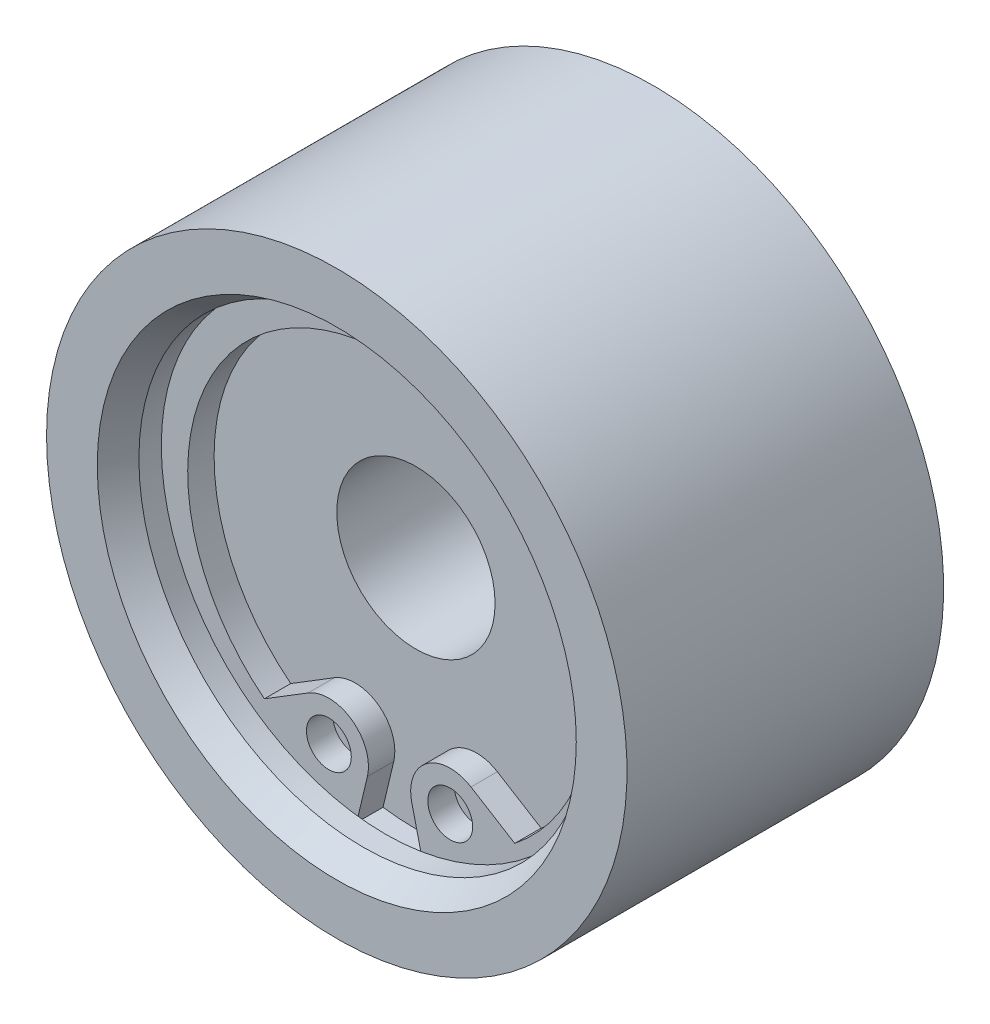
ISO-10303-21;
HEADER;
FILE_DESCRIPTION(('STEP AP214'),'2;1');
FILE_NAME('part.step','',(''),(''),'','','');
FILE_SCHEMA(('AUTOMOTIVE_DESIGN { 1 0 10303 214 1 1 1 1 }'));
ENDSEC;
DATA;
#1=APPLICATION_CONTEXT('core data for automotive mechanical design processes');
#2=APPLICATION_PROTOCOL_DEFINITION('international standard','automotive_design',2000,#1);
#3=PRODUCT_CONTEXT('',#1,'mechanical');
#4=PRODUCT('Part','Part','',(#3));
#5=PRODUCT_RELATED_PRODUCT_CATEGORY('part','',(#4));
#6=PRODUCT_DEFINITION_FORMATION('','',#4);
#7=PRODUCT_DEFINITION_CONTEXT('part definition',#1,'design');
#8=PRODUCT_DEFINITION('design','',#6,#7);
#9=PRODUCT_DEFINITION_SHAPE('','',#8);
#10=(LENGTH_UNIT() NAMED_UNIT(*) SI_UNIT(.MILLI.,.METRE.));
#11=(NAMED_UNIT(*) PLANE_ANGLE_UNIT() SI_UNIT($,.RADIAN.));
#12=(NAMED_UNIT(*) SI_UNIT($,.STERADIAN.) SOLID_ANGLE_UNIT());
#13=UNCERTAINTY_MEASURE_WITH_UNIT(LENGTH_MEASURE(1.E-05),#10,'distance_accuracy_value','');
#14=(GEOMETRIC_REPRESENTATION_CONTEXT(3) GLOBAL_UNCERTAINTY_ASSIGNED_CONTEXT((#13)) GLOBAL_UNIT_ASSIGNED_CONTEXT((#10,
#11,#12)) REPRESENTATION_CONTEXT('',''));
#15=CARTESIAN_POINT('',(0.,0.,0.));
#16=DIRECTION('',(0.,0.,1.));
#17=DIRECTION('',(1.,0.,0.));
#18=AXIS2_PLACEMENT_3D('',#15,#16,#17);
#19=CARTESIAN_POINT('',(0.,3.,3.));
#20=DIRECTION('',(0.,0.,-1.));
#21=DIRECTION('',(-1.,0.,0.));
#22=AXIS2_PLACEMENT_3D('',#19,#20,#21);
#23=PLANE('',#22);
#24=CARTESIAN_POINT('',(2.3,-6.75644413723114,3.));
#25=DIRECTION('',(0.,0.,-1.));
#26=DIRECTION('',(-1.,0.,0.));
#27=AXIS2_PLACEMENT_3D('',#24,#25,#26);
#28=CIRCLE('',#27,0.85);
#29=CARTESIAN_POINT('',(1.45,-6.75644413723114,3.));
#30=VERTEX_POINT('',#29);
#31=EDGE_CURVE('E211',#30,#30,#28,.T.);
#32=ORIENTED_EDGE('',*,*,#31,.F.);
#33=EDGE_LOOP('',(#32));
#34=FACE_BOUND('',#33,.T.);
#35=ADVANCED_FACE('F14',(#34),#23,.F.);
#36=CARTESIAN_POINT('',(-2.3,-6.75644413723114,3.));
#37=DIRECTION('',(0.,0.,-1.));
#38=DIRECTION('',(-1.,0.,0.));
#39=AXIS2_PLACEMENT_3D('',#36,#37,#38);
#40=CIRCLE('',#39,0.85);
#41=CARTESIAN_POINT('',(-3.15,-6.75644413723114,3.));
#42=VERTEX_POINT('',#41);
#43=EDGE_CURVE('E207',#42,#42,#40,.T.);
#44=ORIENTED_EDGE('',*,*,#43,.F.);
#45=EDGE_LOOP('',(#44));
#46=FACE_BOUND('',#45,.T.);
#47=ADVANCED_FACE('F251',(#46),#23,.F.);
#48=CARTESIAN_POINT('',(0.,0.,8.6342229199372));
#49=DIRECTION('',(0.,0.,1.));
#50=DIRECTION('',(1.,0.,0.));
#51=AXIS2_PLACEMENT_3D('',#48,#49,#50);
#52=CYLINDRICAL_SURFACE('',#51,11.);
#53=CARTESIAN_POINT('',(0.,0.,6.));
#54=DIRECTION('',(0.,0.,-1.));
#55=DIRECTION('',(-1.,0.,0.));
#56=AXIS2_PLACEMENT_3D('',#53,#54,#55);
#57=CIRCLE('',#56,11.);
#58=CARTESIAN_POINT('',(-11.,0.,6.));
#59=VERTEX_POINT('',#58);
#60=EDGE_CURVE('E240',#59,#59,#57,.T.);
#61=ORIENTED_EDGE('',*,*,#60,.T.);
#62=EDGE_LOOP('',(#61));
#63=FACE_BOUND('',#62,.T.);
#64=CARTESIAN_POINT('',(0.,0.,-6.));
#65=DIRECTION('',(0.,0.,-1.));
#66=DIRECTION('',(-1.,0.,0.));
#67=AXIS2_PLACEMENT_3D('',#64,#65,#66);
#68=CIRCLE('',#67,11.);
#69=CARTESIAN_POINT('',(-11.,0.,-6.));
#70=VERTEX_POINT('',#69);
#71=EDGE_CURVE('E156',#70,#70,#68,.T.);
#72=ORIENTED_EDGE('',*,*,#71,.F.);
#73=EDGE_LOOP('',(#72));
#74=FACE_BOUND('',#73,.T.);
#75=ADVANCED_FACE('F248',(#63,#74),#52,.T.);
#76=CARTESIAN_POINT('',(0.,15.,6.));
#77=DIRECTION('',(0.,0.,-1.));
#78=DIRECTION('',(-1.,0.,0.));
#79=AXIS2_PLACEMENT_3D('',#76,#77,#78);
#80=PLANE('',#79);
#81=CARTESIAN_POINT('',(0.,0.,6.));
#82=DIRECTION('',(0.,0.,1.));
#83=DIRECTION('',(1.,0.,0.));
#84=AXIS2_PLACEMENT_3D('',#81,#82,#83);
#85=CIRCLE('',#84,9.07735026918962);
#86=CARTESIAN_POINT('',(9.07735026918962,0.,6.));
#87=VERTEX_POINT('',#86);
#88=EDGE_CURVE('E215',#87,#87,#85,.T.);
#89=ORIENTED_EDGE('',*,*,#88,.F.);
#90=EDGE_LOOP('',(#89));
#91=FACE_BOUND('',#90,.T.);
#92=ORIENTED_EDGE('',*,*,#60,.F.);
#93=EDGE_LOOP('',(#92));
#94=FACE_BOUND('',#93,.T.);
#95=ADVANCED_FACE('F250',(#91,#94),#80,.F.);
#96=CARTESIAN_POINT('',(0.,6.5,-6.));
#97=DIRECTION('',(0.,0.,1.));
#98=DIRECTION('',(1.,0.,0.));
#99=AXIS2_PLACEMENT_3D('',#96,#97,#98);
#100=PLANE('',#99);
#101=CARTESIAN_POINT('',(0.,0.,-6.));
#102=DIRECTION('',(0.,0.,1.));
#103=DIRECTION('',(1.,0.,0.));
#104=AXIS2_PLACEMENT_3D('',#101,#102,#103);
#105=CIRCLE('',#104,6.5);
#106=CARTESIAN_POINT('',(6.5,0.,-6.));
#107=VERTEX_POINT('',#106);
#108=EDGE_CURVE('E237',#107,#107,#105,.T.);
#109=ORIENTED_EDGE('',*,*,#108,.T.);
#110=EDGE_LOOP('',(#109));
#111=FACE_BOUND('',#110,.T.);
#112=ORIENTED_EDGE('',*,*,#71,.T.);
#113=EDGE_LOOP('',(#112));
#114=FACE_BOUND('',#113,.T.);
#115=ADVANCED_FACE('F246',(#111,#114),#100,.F.);
#116=CARTESIAN_POINT('',(0.,0.,6.));
#117=DIRECTION('',(0.,0.,1.));
#118=DIRECTION('',(1.,0.,0.));
#119=AXIS2_PLACEMENT_3D('',#116,#117,#118);
#120=CONICAL_SURFACE('',#119,9.07735026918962,0.523598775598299);
#121=CARTESIAN_POINT('',(0.,0.,5.));
#122=DIRECTION('',(0.,0.,1.));
#123=DIRECTION('',(1.,0.,0.));
#124=AXIS2_PLACEMENT_3D('',#121,#122,#123);
#125=CIRCLE('',#124,8.5);
#126=CARTESIAN_POINT('',(8.5,0.,5.));
#127=VERTEX_POINT('',#126);
#128=EDGE_CURVE('E218',#127,#127,#125,.T.);
#129=ORIENTED_EDGE('',*,*,#128,.F.);
#130=EDGE_LOOP('',(#129));
#131=FACE_BOUND('',#130,.T.);
#132=ORIENTED_EDGE('',*,*,#88,.T.);
#133=EDGE_LOOP('',(#132));
#134=FACE_BOUND('',#133,.T.);
#135=ADVANCED_FACE('F323',(#131,#134),#120,.F.);
#136=CARTESIAN_POINT('',(0.,0.,8.6342229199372));
#137=DIRECTION('',(0.,0.,1.));
#138=DIRECTION('',(1.,0.,0.));
#139=AXIS2_PLACEMENT_3D('',#136,#137,#138);
#140=CYLINDRICAL_SURFACE('',#139,6.5);
#141=ORIENTED_EDGE('',*,*,#108,.F.);
#142=EDGE_LOOP('',(#141));
#143=FACE_BOUND('',#142,.T.);
#144=CARTESIAN_POINT('',(0.,0.,-3.));
#145=DIRECTION('',(0.,0.,1.));
#146=DIRECTION('',(1.,0.,0.));
#147=AXIS2_PLACEMENT_3D('',#144,#145,#146);
#148=CIRCLE('',#147,6.5);
#149=CARTESIAN_POINT('',(6.5,0.,-3.));
#150=VERTEX_POINT('',#149);
#151=EDGE_CURVE('E234',#150,#150,#148,.T.);
#152=ORIENTED_EDGE('',*,*,#151,.T.);
#153=EDGE_LOOP('',(#152));
#154=FACE_BOUND('',#153,.T.);
#155=ADVANCED_FACE('F321',(#143,#154),#140,.F.);
#156=CARTESIAN_POINT('',(0.,0.,8.6342229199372));
#157=DIRECTION('',(0.,0.,1.));
#158=DIRECTION('',(1.,0.,0.));
#159=AXIS2_PLACEMENT_3D('',#156,#157,#158);
#160=CYLINDRICAL_SURFACE('',#159,8.5);
#161=CARTESIAN_POINT('',(0.,0.,4.15));
#162=DIRECTION('',(0.,0.,1.));
#163=DIRECTION('',(1.,0.,0.));
#164=AXIS2_PLACEMENT_3D('',#161,#162,#163);
#165=CIRCLE('',#164,8.5);
#166=CARTESIAN_POINT('',(8.5,0.,4.15));
#167=VERTEX_POINT('',#166);
#168=EDGE_CURVE('E221',#167,#167,#165,.T.);
#169=ORIENTED_EDGE('',*,*,#168,.F.);
#170=EDGE_LOOP('',(#169));
#171=FACE_BOUND('',#170,.T.);
#172=ORIENTED_EDGE('',*,*,#128,.T.);
#173=EDGE_LOOP('',(#172));
#174=FACE_BOUND('',#173,.T.);
#175=ADVANCED_FACE('F318',(#171,#174),#160,.F.);
#176=CARTESIAN_POINT('',(0.,6.5,-3.));
#177=DIRECTION('',(0.,0.,1.));
#178=DIRECTION('',(1.,0.,0.));
#179=AXIS2_PLACEMENT_3D('',#176,#177,#178);
#180=PLANE('',#179);
#181=ORIENTED_EDGE('',*,*,#151,.F.);
#182=EDGE_LOOP('',(#181));
#183=FACE_BOUND('',#182,.T.);
#184=CARTESIAN_POINT('',(0.,0.,-3.));
#185=DIRECTION('',(0.,0.,1.));
#186=DIRECTION('',(1.,0.,0.));
#187=AXIS2_PLACEMENT_3D('',#184,#185,#186);
#188=CIRCLE('',#187,3.);
#189=CARTESIAN_POINT('',(3.,0.,-3.));
#190=VERTEX_POINT('',#189);
#191=EDGE_CURVE('E231',#190,#190,#188,.T.);
#192=ORIENTED_EDGE('',*,*,#191,.T.);
#193=EDGE_LOOP('',(#192));
#194=FACE_BOUND('',#193,.T.);
#195=ADVANCED_FACE('F316',(#183,#194),#180,.F.);
#196=CARTESIAN_POINT('',(0.,8.9,4.15));
#197=DIRECTION('',(0.,0.,1.));
#198=DIRECTION('',(1.,0.,0.));
#199=AXIS2_PLACEMENT_3D('',#196,#197,#198);
#200=PLANE('',#199);
#201=CARTESIAN_POINT('',(0.,0.,4.15));
#202=DIRECTION('',(0.,0.,1.));
#203=DIRECTION('',(1.,0.,0.));
#204=AXIS2_PLACEMENT_3D('',#201,#202,#203);
#205=CIRCLE('',#204,8.9);
#206=CARTESIAN_POINT('',(8.9,0.,4.15));
#207=VERTEX_POINT('',#206);
#208=EDGE_CURVE('E224',#207,#207,#205,.T.);
#209=ORIENTED_EDGE('',*,*,#208,.F.);
#210=EDGE_LOOP('',(#209));
#211=FACE_BOUND('',#210,.T.);
#212=ORIENTED_EDGE('',*,*,#168,.T.);
#213=EDGE_LOOP('',(#212));
#214=FACE_BOUND('',#213,.T.);
#215=ADVANCED_FACE('F312',(#211,#214),#200,.F.);
#216=CARTESIAN_POINT('',(0.,0.,8.6342229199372));
#217=DIRECTION('',(0.,0.,1.));
#218=DIRECTION('',(1.,0.,0.));
#219=AXIS2_PLACEMENT_3D('',#216,#217,#218);
#220=CYLINDRICAL_SURFACE('',#219,8.9);
#221=ORIENTED_EDGE('',*,*,#208,.T.);
#222=EDGE_LOOP('',(#221));
#223=FACE_BOUND('',#222,.T.);
#224=DIRECTION('',(0.,0.,1.));
#225=VECTOR('',#224,1.);
#226=CARTESIAN_POINT('',(1.24703201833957,-8.81220240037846,8.6342229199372));
#227=LINE('',#226,#225);
#228=CARTESIAN_POINT('',(1.24703201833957,-8.81220240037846,3.));
#229=VERTEX_POINT('',#228);
#230=CARTESIAN_POINT('',(1.24703201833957,-8.81220240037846,4.));
#231=VERTEX_POINT('',#230);
#232=EDGE_CURVE('E9',#229,#231,#227,.T.);
#233=ORIENTED_EDGE('',*,*,#232,.F.);
#234=CARTESIAN_POINT('',(0.,0.,3.));
#235=DIRECTION('',(0.,0.,1.));
#236=DIRECTION('',(1.,0.,0.));
#237=AXIS2_PLACEMENT_3D('',#234,#235,#236);
#238=CIRCLE('',#237,8.9);
#239=CARTESIAN_POINT('',(-1.24703201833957,-8.81220240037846,3.));
#240=VERTEX_POINT('',#239);
#241=EDGE_CURVE('E103',#240,#229,#238,.T.);
#242=ORIENTED_EDGE('',*,*,#241,.F.);
#243=DIRECTION('',(0.,0.,1.));
#244=VECTOR('',#243,1.);
#245=CARTESIAN_POINT('',(-1.24703201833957,-8.81220240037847,8.6342229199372));
#246=LINE('',#245,#244);
#247=CARTESIAN_POINT('',(-1.24703201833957,-8.81220240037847,4.));
#248=VERTEX_POINT('',#247);
#249=EDGE_CURVE('E106',#248,#240,#246,.F.);
#250=ORIENTED_EDGE('',*,*,#249,.F.);
#251=CARTESIAN_POINT('',(0.,0.,4.));
#252=DIRECTION('',(0.,0.,-1.));
#253=DIRECTION('',(-1.,0.,0.));
#254=AXIS2_PLACEMENT_3D('',#251,#252,#253);
#255=CIRCLE('',#254,8.9);
#256=EDGE_CURVE('E23',#231,#248,#255,.F.);
#257=ORIENTED_EDGE('',*,*,#256,.F.);
#258=EDGE_LOOP('',(#233,#242,#250,#257));
#259=FACE_BOUND('',#258,.T.);
#260=ADVANCED_FACE('F309',(#223,#259),#220,.F.);
#261=CARTESIAN_POINT('',(0.,0.,8.6342229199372));
#262=DIRECTION('',(0.,0.,1.));
#263=DIRECTION('',(1.,0.,0.));
#264=AXIS2_PLACEMENT_3D('',#261,#262,#263);
#265=CYLINDRICAL_SURFACE('',#264,3.);
#266=ORIENTED_EDGE('',*,*,#191,.F.);
#267=EDGE_LOOP('',(#266));
#268=FACE_BOUND('',#267,.T.);
#269=CARTESIAN_POINT('',(0.,0.,3.));
#270=DIRECTION('',(0.,0.,1.));
#271=DIRECTION('',(1.,0.,0.));
#272=AXIS2_PLACEMENT_3D('',#269,#270,#271);
#273=CIRCLE('',#272,3.);
#274=CARTESIAN_POINT('',(3.,0.,3.));
#275=VERTEX_POINT('',#274);
#276=EDGE_CURVE('E228',#275,#275,#273,.T.);
#277=ORIENTED_EDGE('',*,*,#276,.T.);
#278=EDGE_LOOP('',(#277));
#279=FACE_BOUND('',#278,.T.);
#280=ADVANCED_FACE('F271',(#268,#279),#265,.F.);
#281=ORIENTED_EDGE('',*,*,#276,.F.);
#282=EDGE_LOOP('',(#281));
#283=FACE_BOUND('',#282,.T.);
#284=DIRECTION('',(0.231349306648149,-0.972870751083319,0.));
#285=VECTOR('',#284,1.);
#286=CARTESIAN_POINT('',(-1.47831977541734,2.648454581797,3.));
#287=LINE('',#286,#285);
#288=CARTESIAN_POINT('',(0.840693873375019,-7.10346809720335,3.));
#289=VERTEX_POINT('',#288);
#290=EDGE_CURVE('E97',#289,#229,#287,.T.);
#291=ORIENTED_EDGE('',*,*,#290,.F.);
#292=CARTESIAN_POINT('',(2.3,-6.75644413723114,3.));
#293=DIRECTION('',(0.,0.,-1.));
#294=DIRECTION('',(-1.,0.,0.));
#295=AXIS2_PLACEMENT_3D('',#292,#293,#294);
#296=CIRCLE('',#295,1.5);
#297=CARTESIAN_POINT('',(3.08650226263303,-5.47917588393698,3.));
#298=VERTEX_POINT('',#297);
#299=EDGE_CURVE('E100',#289,#298,#296,.T.);
#300=ORIENTED_EDGE('',*,*,#299,.T.);
#301=DIRECTION('',(-0.851512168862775,0.524334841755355,0.));
#302=VECTOR('',#301,1.);
#303=CARTESIAN_POINT('',(-2.93719834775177,-1.76996746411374,3.));
#304=LINE('',#303,#302);
#305=CARTESIAN_POINT('',(4.745138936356,-6.50051301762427,3.));
#306=VERTEX_POINT('',#305);
#307=EDGE_CURVE('E115',#306,#298,#304,.T.);
#308=ORIENTED_EDGE('',*,*,#307,.F.);
#309=CARTESIAN_POINT('',(0.,-0.5,3.));
#310=DIRECTION('',(0.,0.,-1.));
#311=DIRECTION('',(-1.,0.,0.));
#312=AXIS2_PLACEMENT_3D('',#309,#310,#311);
#313=CIRCLE('',#312,7.65);
#314=CARTESIAN_POINT('',(-4.74513893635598,-6.50051301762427,3.));
#315=VERTEX_POINT('',#314);
#316=EDGE_CURVE('E196',#315,#306,#313,.T.);
#317=ORIENTED_EDGE('',*,*,#316,.F.);
#318=DIRECTION('',(-0.851512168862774,-0.524334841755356,0.));
#319=VECTOR('',#318,1.);
#320=CARTESIAN_POINT('',(2.93719834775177,-1.76996746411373,3.));
#321=LINE('',#320,#319);
#322=CARTESIAN_POINT('',(-3.08650226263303,-5.47917588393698,3.));
#323=VERTEX_POINT('',#322);
#324=EDGE_CURVE('E185',#323,#315,#321,.T.);
#325=ORIENTED_EDGE('',*,*,#324,.F.);
#326=CARTESIAN_POINT('',(-2.3,-6.75644413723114,3.));
#327=DIRECTION('',(0.,0.,-1.));
#328=DIRECTION('',(-1.,0.,0.));
#329=AXIS2_PLACEMENT_3D('',#326,#327,#328);
#330=CIRCLE('',#329,1.5);
#331=CARTESIAN_POINT('',(-0.840693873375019,-7.10346809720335,3.));
#332=VERTEX_POINT('',#331);
#333=EDGE_CURVE('E181',#323,#332,#330,.T.);
#334=ORIENTED_EDGE('',*,*,#333,.T.);
#335=DIRECTION('',(0.231349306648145,0.97287075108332,0.));
#336=VECTOR('',#335,1.);
#337=CARTESIAN_POINT('',(1.4783197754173,2.64845458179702,3.));
#338=LINE('',#337,#336);
#339=EDGE_CURVE('E68',#240,#332,#338,.T.);
#340=ORIENTED_EDGE('',*,*,#339,.F.);
#341=ORIENTED_EDGE('',*,*,#241,.T.);
#342=EDGE_LOOP('',(#291,#300,#308,#317,#325,#334,#340,#341));
#343=FACE_BOUND('',#342,.T.);
#344=ADVANCED_FACE('F99',(#283,#343),#23,.F.);
#345=CARTESIAN_POINT('',(0.,-0.5,4.));
#346=DIRECTION('',(0.,0.,1.));
#347=DIRECTION('',(-1.,0.,0.));
#348=AXIS2_PLACEMENT_3D('',#345,#346,#347);
#349=CYLINDRICAL_SURFACE('',#348,7.65);
#350=ORIENTED_EDGE('',*,*,#316,.T.);
#351=DIRECTION('',(0.,0.,-1.));
#352=VECTOR('',#351,1.);
#353=CARTESIAN_POINT('',(4.74513893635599,-6.50051301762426,4.));
#354=LINE('',#353,#352);
#355=CARTESIAN_POINT('',(4.74513893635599,-6.50051301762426,4.));
#356=VERTEX_POINT('',#355);
#357=EDGE_CURVE('E145',#356,#306,#354,.T.);
#358=ORIENTED_EDGE('',*,*,#357,.F.);
#359=CARTESIAN_POINT('',(0.,-0.5,4.));
#360=DIRECTION('',(0.,0.,-1.));
#361=DIRECTION('',(0.,-1.,0.));
#362=AXIS2_PLACEMENT_3D('',#359,#360,#361);
#363=CIRCLE('',#362,7.65);
#364=CARTESIAN_POINT('',(-4.74513893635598,-6.50051301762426,4.));
#365=VERTEX_POINT('',#364);
#366=EDGE_CURVE('E138',#365,#356,#363,.T.);
#367=ORIENTED_EDGE('',*,*,#366,.F.);
#368=DIRECTION('',(0.,0.,-1.));
#369=VECTOR('',#368,1.);
#370=CARTESIAN_POINT('',(-4.74513893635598,-6.50051301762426,4.));
#371=LINE('',#370,#369);
#372=EDGE_CURVE('E140',#365,#315,#371,.T.);
#373=ORIENTED_EDGE('',*,*,#372,.T.);
#374=EDGE_LOOP('',(#350,#358,#367,#373));
#375=FACE_BOUND('',#374,.T.);
#376=ADVANCED_FACE('F190',(#375),#349,.F.);
#377=CARTESIAN_POINT('',(3.08650226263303,-5.47917588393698,4.));
#378=DIRECTION('',(-0.524334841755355,-0.851512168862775,0.));
#379=DIRECTION('',(-0.851512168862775,0.524334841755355,0.));
#380=AXIS2_PLACEMENT_3D('',#377,#378,#379);
#381=PLANE('',#380);
#382=ORIENTED_EDGE('',*,*,#307,.T.);
#383=DIRECTION('',(0.,0.,-1.));
#384=VECTOR('',#383,1.);
#385=CARTESIAN_POINT('',(3.08650226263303,-5.47917588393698,4.));
#386=LINE('',#385,#384);
#387=CARTESIAN_POINT('',(3.08650226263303,-5.47917588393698,4.));
#388=VERTEX_POINT('',#387);
#389=EDGE_CURVE('E113',#388,#298,#386,.T.);
#390=ORIENTED_EDGE('',*,*,#389,.F.);
#391=DIRECTION('',(-0.851512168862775,0.524334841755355,0.));
#392=VECTOR('',#391,1.);
#393=CARTESIAN_POINT('',(3.08650226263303,-5.47917588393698,4.));
#394=LINE('',#393,#392);
#395=EDGE_CURVE('E134',#356,#388,#394,.T.);
#396=ORIENTED_EDGE('',*,*,#395,.F.);
#397=ORIENTED_EDGE('',*,*,#357,.T.);
#398=EDGE_LOOP('',(#382,#390,#396,#397));
#399=FACE_BOUND('',#398,.T.);
#400=ADVANCED_FACE('F194',(#399),#381,.F.);
#401=CARTESIAN_POINT('',(2.3,-6.75644413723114,4.));
#402=DIRECTION('',(0.,0.,1.));
#403=DIRECTION('',(-1.,0.,0.));
#404=AXIS2_PLACEMENT_3D('',#401,#402,#403);
#405=CYLINDRICAL_SURFACE('',#404,1.5);
#406=ORIENTED_EDGE('',*,*,#299,.F.);
#407=DIRECTION('',(0.,0.,-1.));
#408=VECTOR('',#407,1.);
#409=CARTESIAN_POINT('',(0.840693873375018,-7.10346809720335,4.));
#410=LINE('',#409,#408);
#411=CARTESIAN_POINT('',(0.840693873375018,-7.10346809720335,4.));
#412=VERTEX_POINT('',#411);
#413=EDGE_CURVE('E111',#412,#289,#410,.T.);
#414=ORIENTED_EDGE('',*,*,#413,.F.);
#415=CARTESIAN_POINT('',(2.3,-6.75644413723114,4.));
#416=DIRECTION('',(0.,0.,1.));
#417=DIRECTION('',(1.,0.,0.));
#418=AXIS2_PLACEMENT_3D('',#415,#416,#417);
#419=CIRCLE('',#418,1.5);
#420=EDGE_CURVE('E139',#388,#412,#419,.T.);
#421=ORIENTED_EDGE('',*,*,#420,.F.);
#422=ORIENTED_EDGE('',*,*,#389,.T.);
#423=EDGE_LOOP('',(#406,#414,#421,#422));
#424=FACE_BOUND('',#423,.T.);
#425=ADVANCED_FACE('F16',(#424),#405,.T.);
#426=CARTESIAN_POINT('',(-0.84069387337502,-7.10346809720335,4.));
#427=DIRECTION('',(-0.97287075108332,0.231349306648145,0.));
#428=DIRECTION('',(0.,0.,1.));
#429=AXIS2_PLACEMENT_3D('',#426,#427,#428);
#430=PLANE('',#429);
#431=DIRECTION('',(0.231349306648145,0.97287075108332,0.));
#432=VECTOR('',#431,1.);
#433=CARTESIAN_POINT('',(-0.84069387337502,-7.10346809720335,4.));
#434=LINE('',#433,#432);
#435=CARTESIAN_POINT('',(-0.84069387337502,-7.10346809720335,4.));
#436=VERTEX_POINT('',#435);
#437=EDGE_CURVE('E162',#248,#436,#434,.T.);
#438=ORIENTED_EDGE('',*,*,#437,.F.);
#439=ORIENTED_EDGE('',*,*,#249,.T.);
#440=ORIENTED_EDGE('',*,*,#339,.T.);
#441=DIRECTION('',(0.,0.,-1.));
#442=VECTOR('',#441,1.);
#443=CARTESIAN_POINT('',(-0.84069387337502,-7.10346809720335,4.));
#444=LINE('',#443,#442);
#445=EDGE_CURVE('E122',#436,#332,#444,.T.);
#446=ORIENTED_EDGE('',*,*,#445,.F.);
#447=EDGE_LOOP('',(#438,#439,#440,#446));
#448=FACE_BOUND('',#447,.T.);
#449=ADVANCED_FACE('F176',(#448),#430,.F.);
#450=CARTESIAN_POINT('',(0.,-0.5,4.));
#451=DIRECTION('',(0.,0.,-1.));
#452=DIRECTION('',(0.,-1.,0.));
#453=AXIS2_PLACEMENT_3D('',#450,#451,#452);
#454=PLANE('',#453);
#455=CARTESIAN_POINT('',(-2.3,-6.75644413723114,4.));
#456=DIRECTION('',(0.,0.,-1.));
#457=DIRECTION('',(1.,0.,0.));
#458=AXIS2_PLACEMENT_3D('',#455,#456,#457);
#459=CIRCLE('',#458,0.85);
#460=CARTESIAN_POINT('',(-1.45,-6.75644413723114,4.));
#461=VERTEX_POINT('',#460);
#462=EDGE_CURVE('E127',#461,#461,#459,.T.);
#463=ORIENTED_EDGE('',*,*,#462,.T.);
#464=EDGE_LOOP('',(#463));
#465=FACE_BOUND('',#464,.T.);
#466=CARTESIAN_POINT('',(2.3,-6.75644413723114,4.));
#467=DIRECTION('',(0.,0.,1.));
#468=DIRECTION('',(1.,0.,0.));
#469=AXIS2_PLACEMENT_3D('',#466,#467,#468);
#470=CIRCLE('',#469,0.85);
#471=CARTESIAN_POINT('',(3.15,-6.75644413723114,4.));
#472=VERTEX_POINT('',#471);
#473=EDGE_CURVE('E130',#472,#472,#470,.T.);
#474=ORIENTED_EDGE('',*,*,#473,.F.);
#475=EDGE_LOOP('',(#474));
#476=FACE_BOUND('',#475,.T.);
#477=DIRECTION('',(0.231349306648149,-0.972870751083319,0.));
#478=VECTOR('',#477,1.);
#479=CARTESIAN_POINT('',(0.840693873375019,-7.10346809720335,4.));
#480=LINE('',#479,#478);
#481=EDGE_CURVE('E119',#412,#231,#480,.T.);
#482=ORIENTED_EDGE('',*,*,#481,.T.);
#483=ORIENTED_EDGE('',*,*,#256,.T.);
#484=ORIENTED_EDGE('',*,*,#437,.T.);
#485=CARTESIAN_POINT('',(-2.3,-6.75644413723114,4.));
#486=DIRECTION('',(0.,0.,1.));
#487=DIRECTION('',(-1.,0.,0.));
#488=AXIS2_PLACEMENT_3D('',#485,#486,#487);
#489=CIRCLE('',#488,1.5);
#490=CARTESIAN_POINT('',(-3.08650226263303,-5.47917588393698,4.));
#491=VERTEX_POINT('',#490);
#492=EDGE_CURVE('E151',#436,#491,#489,.T.);
#493=ORIENTED_EDGE('',*,*,#492,.T.);
#494=DIRECTION('',(-0.851512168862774,-0.524334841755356,0.));
#495=VECTOR('',#494,1.);
#496=CARTESIAN_POINT('',(-3.08650226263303,-5.47917588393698,4.));
#497=LINE('',#496,#495);
#498=EDGE_CURVE('E59',#491,#365,#497,.T.);
#499=ORIENTED_EDGE('',*,*,#498,.T.);
#500=ORIENTED_EDGE('',*,*,#366,.T.);
#501=ORIENTED_EDGE('',*,*,#395,.T.);
#502=ORIENTED_EDGE('',*,*,#420,.T.);
#503=EDGE_LOOP('',(#482,#483,#484,#493,#499,#500,#501,#502));
#504=FACE_BOUND('',#503,.T.);
#505=ADVANCED_FACE('F173',(#465,#476,#504),#454,.F.);
#506=CARTESIAN_POINT('',(2.3,-6.75644413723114,4.));
#507=DIRECTION('',(0.,0.,1.));
#508=DIRECTION('',(-1.,0.,0.));
#509=AXIS2_PLACEMENT_3D('',#506,#507,#508);
#510=CYLINDRICAL_SURFACE('',#509,0.85);
#511=ORIENTED_EDGE('',*,*,#31,.T.);
#512=EDGE_LOOP('',(#511));
#513=FACE_BOUND('',#512,.T.);
#514=ORIENTED_EDGE('',*,*,#473,.T.);
#515=EDGE_LOOP('',(#514));
#516=FACE_BOUND('',#515,.T.);
#517=ADVANCED_FACE('F276',(#513,#516),#510,.F.);
#518=CARTESIAN_POINT('',(-2.3,-6.75644413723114,4.));
#519=DIRECTION('',(0.,0.,1.));
#520=DIRECTION('',(-1.,0.,0.));
#521=AXIS2_PLACEMENT_3D('',#518,#519,#520);
#522=CYLINDRICAL_SURFACE('',#521,0.85);
#523=ORIENTED_EDGE('',*,*,#43,.T.);
#524=EDGE_LOOP('',(#523));
#525=FACE_BOUND('',#524,.T.);
#526=ORIENTED_EDGE('',*,*,#462,.F.);
#527=EDGE_LOOP('',(#526));
#528=FACE_BOUND('',#527,.T.);
#529=ADVANCED_FACE('F282',(#525,#528),#522,.F.);
#530=CARTESIAN_POINT('',(-3.08650226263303,-5.47917588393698,4.));
#531=DIRECTION('',(0.524334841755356,-0.851512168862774,0.));
#532=DIRECTION('',(0.,0.,-1.));
#533=AXIS2_PLACEMENT_3D('',#530,#531,#532);
#534=PLANE('',#533);
#535=ORIENTED_EDGE('',*,*,#324,.T.);
#536=ORIENTED_EDGE('',*,*,#372,.F.);
#537=ORIENTED_EDGE('',*,*,#498,.F.);
#538=DIRECTION('',(0.,0.,-1.));
#539=VECTOR('',#538,1.);
#540=CARTESIAN_POINT('',(-3.08650226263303,-5.47917588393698,4.));
#541=LINE('',#540,#539);
#542=EDGE_CURVE('E144',#491,#323,#541,.T.);
#543=ORIENTED_EDGE('',*,*,#542,.T.);
#544=EDGE_LOOP('',(#535,#536,#537,#543));
#545=FACE_BOUND('',#544,.T.);
#546=ADVANCED_FACE('F184',(#545),#534,.F.);
#547=CARTESIAN_POINT('',(-2.3,-6.75644413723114,4.));
#548=DIRECTION('',(0.,0.,1.));
#549=DIRECTION('',(-1.,0.,0.));
#550=AXIS2_PLACEMENT_3D('',#547,#548,#549);
#551=CYLINDRICAL_SURFACE('',#550,1.5);
#552=ORIENTED_EDGE('',*,*,#333,.F.);
#553=ORIENTED_EDGE('',*,*,#542,.F.);
#554=ORIENTED_EDGE('',*,*,#492,.F.);
#555=ORIENTED_EDGE('',*,*,#445,.T.);
#556=EDGE_LOOP('',(#552,#553,#554,#555));
#557=FACE_BOUND('',#556,.T.);
#558=ADVANCED_FACE('F179',(#557),#551,.T.);
#559=CARTESIAN_POINT('',(0.840693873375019,-7.10346809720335,4.));
#560=DIRECTION('',(0.972870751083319,0.231349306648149,0.));
#561=DIRECTION('',(0.,0.,-1.));
#562=AXIS2_PLACEMENT_3D('',#559,#560,#561);
#563=PLANE('',#562);
#564=ORIENTED_EDGE('',*,*,#290,.T.);
#565=ORIENTED_EDGE('',*,*,#232,.T.);
#566=ORIENTED_EDGE('',*,*,#481,.F.);
#567=ORIENTED_EDGE('',*,*,#413,.T.);
#568=EDGE_LOOP('',(#564,#565,#566,#567));
#569=FACE_BOUND('',#568,.T.);
#570=ADVANCED_FACE('F117',(#569),#563,.F.);
#571=CLOSED_SHELL('',(#35,#47,#75,#95,#115,#135,#155,#175,#195,#215,#260,#280,#344,#376,#400,
#425,#449,#505,#517,#529,#546,#558,#570));
#572=MANIFOLD_SOLID_BREP('B1',#571);
#573=ADVANCED_BREP_SHAPE_REPRESENTATION('',(#18,#572),#14);
#574=SHAPE_DEFINITION_REPRESENTATION(#9,#573);
ENDSEC;
END-ISO-10303-21;
